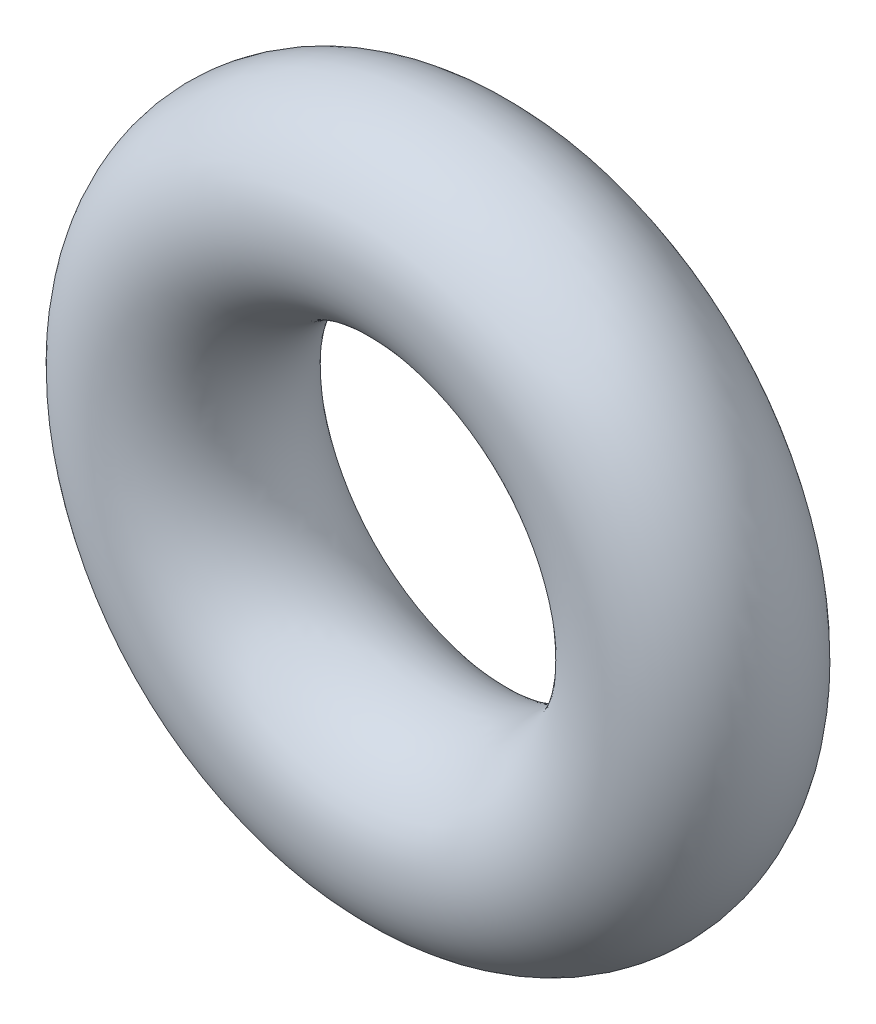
from build123d import *

# Parameters (mm, degrees)
SKETCH1_R = 0.889


with BuildPart() as part:
    # Sketch1 → Revolve1 (revolve)
    with BuildSketch(Plane(origin=(0, 0, 0), x_dir=(0, -1, 0), z_dir=(1, 0, 0)), mode=Mode.PRIVATE) as revolve1_sk:
        with Locations((2.3368, 0)):
            Circle(SKETCH1_R)
    revolve(revolve1_sk.sketch.rotate(Axis((0, 0, 0.889), (0, 0, -1)), 270), axis=Axis((0, 0, 0.889), (0, 0, -1)))


solid = part.part
